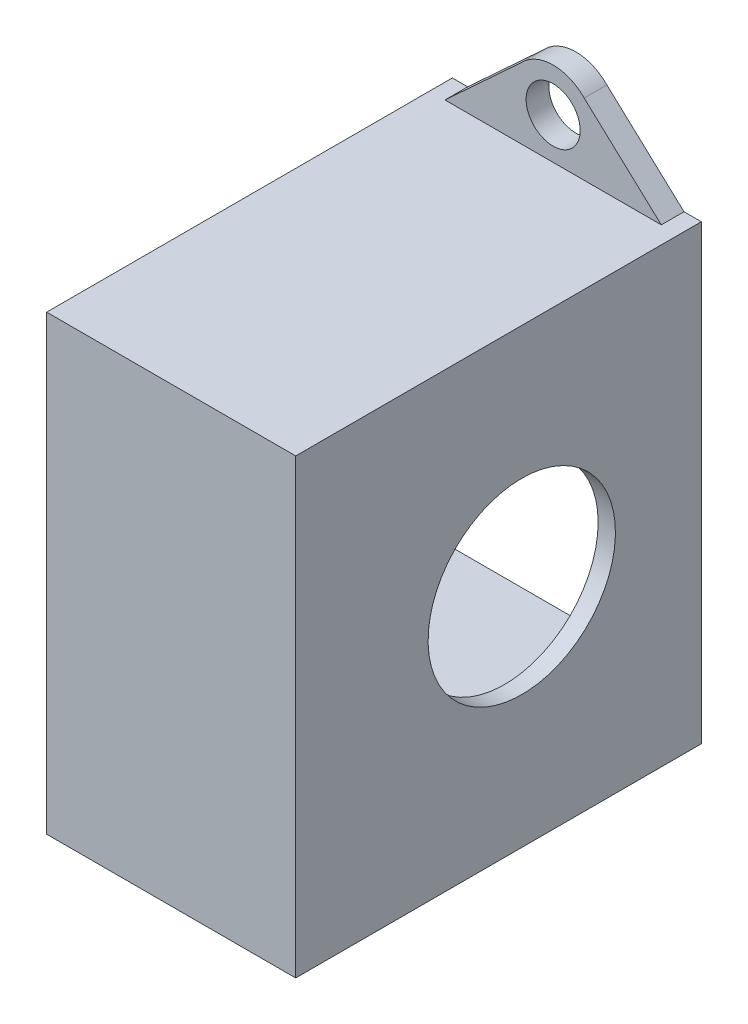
from build123d import *

# Parameters (mm, degrees)
SKETCH1_W           = 27.206886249
SKETCH1_H           = 53.086
BOSS_EXTRUDE1_DEPTH = 5.334
SKETCH2_W           = 27.206886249
SKETCH2_H           = 47.625
BOSS_EXTRUDE2_DEPTH = 5.334
SKETCH3_R           = 3.175
BOSS_EXTRUDE3_DEPTH = 2.667
SKETCH4_W           = 47.625
SKETCH4_H           = 53.086
SKETCH4_R           = 10.9982
BOSS_EXTRUDE4_DEPTH = 2.032


with BuildPart() as part:
    # Sketch1 → Boss-Extrude1 (new body)
    with BuildSketch(Plane.XY):
        with Locations((-757.14416641, 377.726107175)):
            Rectangle(SKETCH1_W, SKETCH1_H)
    extrude(amount=BOSS_EXTRUDE1_DEPTH)

    # Sketch2 → Boss-Extrude2 (add)
    with BuildSketch(Plane(origin=(0, 404.269107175, 0), x_dir=(1, 0, 0), z_dir=(0, 1, 0))):
        with Locations((-757.14416641, 18.4785)):
            Rectangle(SKETCH2_W, SKETCH2_H)
    boss_extrude2 = extrude(amount=-BOSS_EXTRUDE2_DEPTH)

    # Sketch3 → Boss-Extrude3 (add)
    with BuildSketch(Plane(origin=(0, 0, -42.291), x_dir=(-1, 0, 0), z_dir=(0, 0, -1))):
        with BuildLine():
            Line((743.540723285, 404.269107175), (768.940723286, 404.269107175))
            Line((768.940723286, 404.269107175), (759.887506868, 412.631683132))
            ThreePointArc((759.887506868, 412.631683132), (756.240723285, 414.175107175), (752.593939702, 412.631683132))
            Line((752.593939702, 412.631683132), (743.540723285, 404.269107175))
        make_face()
        with Locations((756.240723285, 409.095107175)):
            Circle(SKETCH3_R, mode=Mode.SUBTRACT)
    boss_extrude3 = extrude(amount=-BOSS_EXTRUDE3_DEPTH)

    # Mirror1: Boss-Extrude2, Boss-Extrude3 across plane
    add(boss_extrude2.mirror(Plane(origin=(0, 377.726107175, 0), x_dir=(0, 0, 1), z_dir=(0, -1, 0))))
    add(boss_extrude3.mirror(Plane(origin=(0, 377.726107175, 0), x_dir=(0, 0, 1), z_dir=(0, -1, 0))))

    # Sketch4 → Boss-Extrude4 (add)
    with BuildSketch(Plane(origin=(-743.540723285, 0, 0), x_dir=(0, 0, -1), z_dir=(1, 0, 0))):
        with Locations((18.4785, 377.726107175)):
            Rectangle(SKETCH4_W, SKETCH4_H)
        with Locations(Location((21.209, 377.726107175, 0), (0, 0, 90))):
            Circle(SKETCH4_R, mode=Mode.SUBTRACT)
    extrude(amount=BOSS_EXTRUDE4_DEPTH)


solid = part.part
